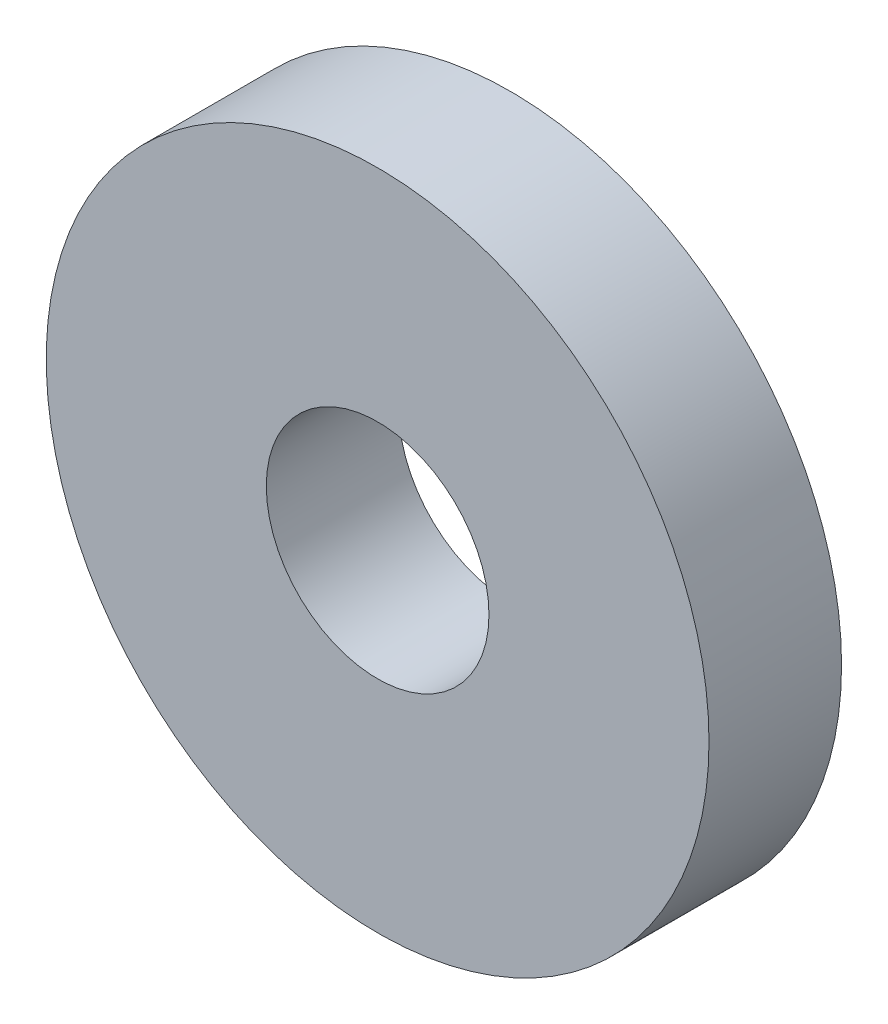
ISO-10303-21;
HEADER;
FILE_DESCRIPTION(('STEP AP214'),'2;1');
FILE_NAME('part.step','',(''),(''),'','','');
FILE_SCHEMA(('AUTOMOTIVE_DESIGN { 1 0 10303 214 1 1 1 1 }'));
ENDSEC;
DATA;
#1=APPLICATION_CONTEXT('core data for automotive mechanical design processes');
#2=APPLICATION_PROTOCOL_DEFINITION('international standard','automotive_design',2000,#1);
#3=PRODUCT_CONTEXT('',#1,'mechanical');
#4=PRODUCT('Part','Part','',(#3));
#5=PRODUCT_RELATED_PRODUCT_CATEGORY('part','',(#4));
#6=PRODUCT_DEFINITION_FORMATION('','',#4);
#7=PRODUCT_DEFINITION_CONTEXT('part definition',#1,'design');
#8=PRODUCT_DEFINITION('design','',#6,#7);
#9=PRODUCT_DEFINITION_SHAPE('','',#8);
#10=(LENGTH_UNIT() NAMED_UNIT(*) SI_UNIT(.MILLI.,.METRE.));
#11=(NAMED_UNIT(*) PLANE_ANGLE_UNIT() SI_UNIT($,.RADIAN.));
#12=(NAMED_UNIT(*) SI_UNIT($,.STERADIAN.) SOLID_ANGLE_UNIT());
#13=UNCERTAINTY_MEASURE_WITH_UNIT(LENGTH_MEASURE(1.E-05),#10,'distance_accuracy_value','');
#14=(GEOMETRIC_REPRESENTATION_CONTEXT(3) GLOBAL_UNCERTAINTY_ASSIGNED_CONTEXT((#13)) GLOBAL_UNIT_ASSIGNED_CONTEXT((#10,
#11,#12)) REPRESENTATION_CONTEXT('',''));
#15=CARTESIAN_POINT('',(0.,0.,0.));
#16=DIRECTION('',(0.,0.,1.));
#17=DIRECTION('',(1.,0.,0.));
#18=AXIS2_PLACEMENT_3D('',#15,#16,#17);
#19=CARTESIAN_POINT('',(0.,0.,5.));
#20=DIRECTION('',(0.,0.,1.));
#21=DIRECTION('',(1.,0.,0.));
#22=AXIS2_PLACEMENT_3D('',#19,#20,#21);
#23=PLANE('',#22);
#24=CARTESIAN_POINT('',(0.,0.,5.));
#25=DIRECTION('',(0.,0.,1.));
#26=DIRECTION('',(1.,0.,0.));
#27=AXIS2_PLACEMENT_3D('',#24,#25,#26);
#28=CIRCLE('',#27,12.5);
#29=CARTESIAN_POINT('',(12.5,0.,5.));
#30=VERTEX_POINT('',#29);
#31=EDGE_CURVE('E8',#30,#30,#28,.T.);
#32=ORIENTED_EDGE('',*,*,#31,.T.);
#33=EDGE_LOOP('',(#32));
#34=FACE_BOUND('',#33,.T.);
#35=CARTESIAN_POINT('',(0.,0.,5.));
#36=DIRECTION('',(0.,0.,1.));
#37=DIRECTION('',(1.,0.,0.));
#38=AXIS2_PLACEMENT_3D('',#35,#36,#37);
#39=CIRCLE('',#38,4.2);
#40=CARTESIAN_POINT('',(4.2,0.,5.));
#41=VERTEX_POINT('',#40);
#42=EDGE_CURVE('E23',#41,#41,#39,.T.);
#43=ORIENTED_EDGE('',*,*,#42,.F.);
#44=EDGE_LOOP('',(#43));
#45=FACE_BOUND('',#44,.T.);
#46=ADVANCED_FACE('F12',(#34,#45),#23,.T.);
#47=CARTESIAN_POINT('',(0.,0.,0.));
#48=DIRECTION('',(0.,0.,1.));
#49=DIRECTION('',(1.,0.,0.));
#50=AXIS2_PLACEMENT_3D('',#47,#48,#49);
#51=PLANE('',#50);
#52=CARTESIAN_POINT('',(0.,0.,0.));
#53=DIRECTION('',(0.,0.,1.));
#54=DIRECTION('',(1.,0.,0.));
#55=AXIS2_PLACEMENT_3D('',#52,#53,#54);
#56=CIRCLE('',#55,12.5);
#57=CARTESIAN_POINT('',(12.5,0.,0.));
#58=VERTEX_POINT('',#57);
#59=EDGE_CURVE('E19',#58,#58,#56,.T.);
#60=ORIENTED_EDGE('',*,*,#59,.F.);
#61=EDGE_LOOP('',(#60));
#62=FACE_BOUND('',#61,.T.);
#63=CARTESIAN_POINT('',(0.,0.,0.));
#64=DIRECTION('',(0.,0.,1.));
#65=DIRECTION('',(1.,0.,0.));
#66=AXIS2_PLACEMENT_3D('',#63,#64,#65);
#67=CIRCLE('',#66,4.2);
#68=CARTESIAN_POINT('',(4.2,0.,0.));
#69=VERTEX_POINT('',#68);
#70=EDGE_CURVE('E27',#69,#69,#67,.T.);
#71=ORIENTED_EDGE('',*,*,#70,.T.);
#72=EDGE_LOOP('',(#71));
#73=FACE_BOUND('',#72,.T.);
#74=ADVANCED_FACE('F33',(#62,#73),#51,.F.);
#75=CARTESIAN_POINT('',(0.,0.,5.));
#76=DIRECTION('',(0.,0.,-1.));
#77=DIRECTION('',(-1.,0.,0.));
#78=AXIS2_PLACEMENT_3D('',#75,#76,#77);
#79=CYLINDRICAL_SURFACE('',#78,12.5);
#80=ORIENTED_EDGE('',*,*,#31,.F.);
#81=EDGE_LOOP('',(#80));
#82=FACE_BOUND('',#81,.T.);
#83=ORIENTED_EDGE('',*,*,#59,.T.);
#84=EDGE_LOOP('',(#83));
#85=FACE_BOUND('',#84,.T.);
#86=ADVANCED_FACE('F14',(#82,#85),#79,.T.);
#87=CARTESIAN_POINT('',(0.,0.,5.));
#88=DIRECTION('',(0.,0.,-1.));
#89=DIRECTION('',(-1.,0.,0.));
#90=AXIS2_PLACEMENT_3D('',#87,#88,#89);
#91=CYLINDRICAL_SURFACE('',#90,4.2);
#92=ORIENTED_EDGE('',*,*,#42,.T.);
#93=EDGE_LOOP('',(#92));
#94=FACE_BOUND('',#93,.T.);
#95=ORIENTED_EDGE('',*,*,#70,.F.);
#96=EDGE_LOOP('',(#95));
#97=FACE_BOUND('',#96,.T.);
#98=ADVANCED_FACE('F35',(#94,#97),#91,.F.);
#99=CLOSED_SHELL('',(#46,#74,#86,#98));
#100=MANIFOLD_SOLID_BREP('B1',#99);
#101=ADVANCED_BREP_SHAPE_REPRESENTATION('',(#18,#100),#14);
#102=SHAPE_DEFINITION_REPRESENTATION(#9,#101);
ENDSEC;
END-ISO-10303-21;
